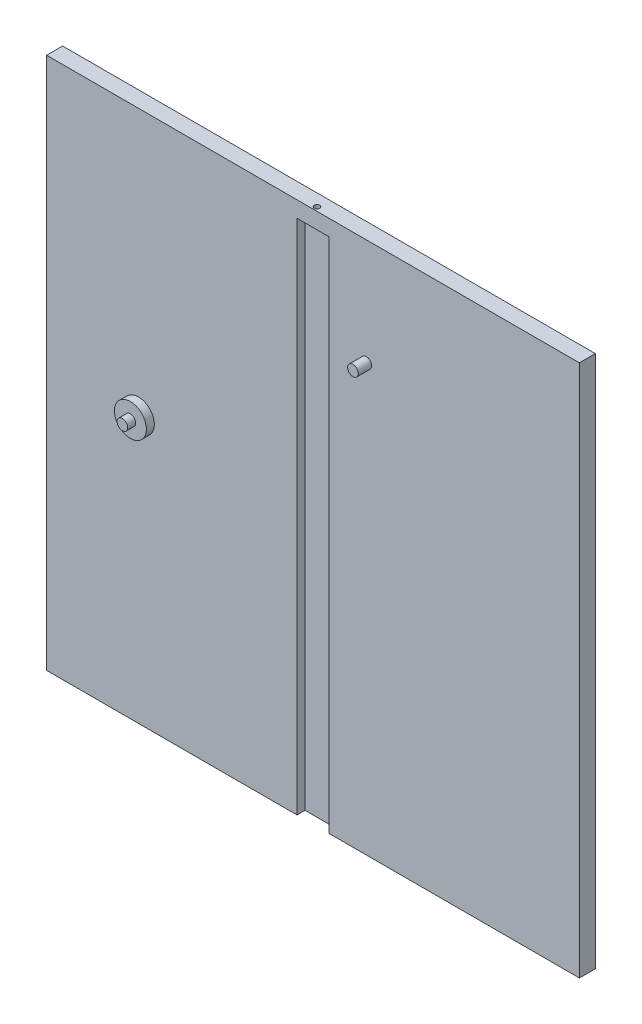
ISO-10303-21;
HEADER;
FILE_DESCRIPTION(('STEP AP214'),'2;1');
FILE_NAME('part.step','',(''),(''),'','','');
FILE_SCHEMA(('AUTOMOTIVE_DESIGN { 1 0 10303 214 1 1 1 1 }'));
ENDSEC;
DATA;
#1=APPLICATION_CONTEXT('core data for automotive mechanical design processes');
#2=APPLICATION_PROTOCOL_DEFINITION('international standard','automotive_design',2000,#1);
#3=PRODUCT_CONTEXT('',#1,'mechanical');
#4=PRODUCT('Part','Part','',(#3));
#5=PRODUCT_RELATED_PRODUCT_CATEGORY('part','',(#4));
#6=PRODUCT_DEFINITION_FORMATION('','',#4);
#7=PRODUCT_DEFINITION_CONTEXT('part definition',#1,'design');
#8=PRODUCT_DEFINITION('design','',#6,#7);
#9=PRODUCT_DEFINITION_SHAPE('','',#8);
#10=(LENGTH_UNIT() NAMED_UNIT(*) SI_UNIT(.MILLI.,.METRE.));
#11=(NAMED_UNIT(*) PLANE_ANGLE_UNIT() SI_UNIT($,.RADIAN.));
#12=(NAMED_UNIT(*) SI_UNIT($,.STERADIAN.) SOLID_ANGLE_UNIT());
#13=UNCERTAINTY_MEASURE_WITH_UNIT(LENGTH_MEASURE(1.E-05),#10,'distance_accuracy_value','');
#14=(GEOMETRIC_REPRESENTATION_CONTEXT(3) GLOBAL_UNCERTAINTY_ASSIGNED_CONTEXT((#13)) GLOBAL_UNIT_ASSIGNED_CONTEXT((#10,
#11,#12)) REPRESENTATION_CONTEXT('',''));
#15=CARTESIAN_POINT('',(0.,0.,0.));
#16=DIRECTION('',(0.,0.,1.));
#17=DIRECTION('',(1.,0.,0.));
#18=AXIS2_PLACEMENT_3D('',#15,#16,#17);
#19=CARTESIAN_POINT('',(100.,100.,6.));
#20=DIRECTION('',(0.,-1.,0.));
#21=DIRECTION('',(0.,0.,-1.));
#22=AXIS2_PLACEMENT_3D('',#19,#20,#21);
#23=PLANE('',#22);
#24=DIRECTION('',(-1.,0.,0.));
#25=VECTOR('',#24,1.);
#26=CARTESIAN_POINT('',(100.,100.,0.));
#27=LINE('',#26,#25);
#28=CARTESIAN_POINT('',(100.,100.,0.));
#29=VERTEX_POINT('',#28);
#30=CARTESIAN_POINT('',(-100.,100.,0.));
#31=VERTEX_POINT('',#30);
#32=EDGE_CURVE('E61',#29,#31,#27,.T.);
#33=ORIENTED_EDGE('',*,*,#32,.T.);
#34=DIRECTION('',(0.,0.,-1.));
#35=VECTOR('',#34,1.);
#36=CARTESIAN_POINT('',(-100.,100.,6.));
#37=LINE('',#36,#35);
#38=CARTESIAN_POINT('',(-100.,100.,6.));
#39=VERTEX_POINT('',#38);
#40=EDGE_CURVE('E139',#39,#31,#37,.T.);
#41=ORIENTED_EDGE('',*,*,#40,.F.);
#42=DIRECTION('',(-1.,0.,0.));
#43=VECTOR('',#42,1.);
#44=CARTESIAN_POINT('',(100.,100.,6.));
#45=LINE('',#44,#43);
#46=CARTESIAN_POINT('',(100.,100.,6.));
#47=VERTEX_POINT('',#46);
#48=EDGE_CURVE('E40',#47,#39,#45,.T.);
#49=ORIENTED_EDGE('',*,*,#48,.F.);
#50=DIRECTION('',(0.,0.,-1.));
#51=VECTOR('',#50,1.);
#52=CARTESIAN_POINT('',(100.,100.,6.));
#53=LINE('',#52,#51);
#54=EDGE_CURVE('E154',#47,#29,#53,.T.);
#55=ORIENTED_EDGE('',*,*,#54,.T.);
#56=EDGE_LOOP('',(#33,#41,#49,#55));
#57=FACE_BOUND('',#56,.T.);
#58=CARTESIAN_POINT('',(0.,100.,4.5));
#59=DIRECTION('',(0.,-1.,0.));
#60=DIRECTION('',(0.,0.,-1.));
#61=AXIS2_PLACEMENT_3D('',#58,#59,#60);
#62=CIRCLE('',#61,1.);
#63=CARTESIAN_POINT('',(0.,100.,3.5));
#64=VERTEX_POINT('',#63);
#65=EDGE_CURVE('E179',#64,#64,#62,.F.);
#66=ORIENTED_EDGE('',*,*,#65,.F.);
#67=EDGE_LOOP('',(#66));
#68=FACE_BOUND('',#67,.T.);
#69=ADVANCED_FACE('F15',(#57,#68),#23,.F.);
#70=CARTESIAN_POINT('',(6.,94.,3.));
#71=DIRECTION('',(0.,1.,0.));
#72=DIRECTION('',(0.,0.,1.));
#73=AXIS2_PLACEMENT_3D('',#70,#71,#72);
#74=PLANE('',#73);
#75=DIRECTION('',(-1.,0.,0.));
#76=VECTOR('',#75,1.);
#77=CARTESIAN_POINT('',(6.,94.,6.));
#78=LINE('',#77,#76);
#79=CARTESIAN_POINT('',(6.00000000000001,94.,6.));
#80=VERTEX_POINT('',#79);
#81=CARTESIAN_POINT('',(-6.,94.,6.));
#82=VERTEX_POINT('',#81);
#83=EDGE_CURVE('E109',#80,#82,#78,.T.);
#84=ORIENTED_EDGE('',*,*,#83,.T.);
#85=DIRECTION('',(0.,0.,1.));
#86=VECTOR('',#85,1.);
#87=CARTESIAN_POINT('',(-6.,94.,3.));
#88=LINE('',#87,#86);
#89=CARTESIAN_POINT('',(-6.,94.,3.));
#90=VERTEX_POINT('',#89);
#91=EDGE_CURVE('E121',#90,#82,#88,.T.);
#92=ORIENTED_EDGE('',*,*,#91,.F.);
#93=DIRECTION('',(-1.,0.,0.));
#94=VECTOR('',#93,1.);
#95=CARTESIAN_POINT('',(6.,94.,3.));
#96=LINE('',#95,#94);
#97=CARTESIAN_POINT('',(6.,94.,3.));
#98=VERTEX_POINT('',#97);
#99=EDGE_CURVE('E108',#98,#90,#96,.T.);
#100=ORIENTED_EDGE('',*,*,#99,.F.);
#101=DIRECTION('',(0.,0.,1.));
#102=VECTOR('',#101,1.);
#103=CARTESIAN_POINT('',(6.,94.,3.));
#104=LINE('',#103,#102);
#105=EDGE_CURVE('E131',#98,#80,#104,.T.);
#106=ORIENTED_EDGE('',*,*,#105,.T.);
#107=EDGE_LOOP('',(#84,#92,#100,#106));
#108=FACE_BOUND('',#107,.T.);
#109=CARTESIAN_POINT('',(0.,94.,4.5));
#110=DIRECTION('',(0.,1.,0.));
#111=DIRECTION('',(1.,0.,0.));
#112=AXIS2_PLACEMENT_3D('',#109,#110,#111);
#113=CIRCLE('',#112,1.);
#114=CARTESIAN_POINT('',(0.,94.,3.5));
#115=VERTEX_POINT('',#114);
#116=EDGE_CURVE('E170',#115,#115,#113,.T.);
#117=ORIENTED_EDGE('',*,*,#116,.T.);
#118=EDGE_LOOP('',(#117));
#119=FACE_BOUND('',#118,.T.);
#120=ADVANCED_FACE('F203',(#108,#119),#74,.F.);
#121=CARTESIAN_POINT('',(-100.,100.,6.));
#122=DIRECTION('',(1.,0.,0.));
#123=DIRECTION('',(0.,0.,-1.));
#124=AXIS2_PLACEMENT_3D('',#121,#122,#123);
#125=PLANE('',#124);
#126=DIRECTION('',(0.,-1.,0.));
#127=VECTOR('',#126,1.);
#128=CARTESIAN_POINT('',(-100.,100.,0.));
#129=LINE('',#128,#127);
#130=CARTESIAN_POINT('',(-100.,-100.,0.));
#131=VERTEX_POINT('',#130);
#132=EDGE_CURVE('E98',#31,#131,#129,.T.);
#133=ORIENTED_EDGE('',*,*,#132,.T.);
#134=DIRECTION('',(0.,0.,-1.));
#135=VECTOR('',#134,1.);
#136=CARTESIAN_POINT('',(-100.,-100.,6.));
#137=LINE('',#136,#135);
#138=CARTESIAN_POINT('',(-100.,-100.,6.));
#139=VERTEX_POINT('',#138);
#140=EDGE_CURVE('E159',#139,#131,#137,.T.);
#141=ORIENTED_EDGE('',*,*,#140,.F.);
#142=DIRECTION('',(0.,-1.,0.));
#143=VECTOR('',#142,1.);
#144=CARTESIAN_POINT('',(-100.,100.,6.));
#145=LINE('',#144,#143);
#146=EDGE_CURVE('E140',#39,#139,#145,.T.);
#147=ORIENTED_EDGE('',*,*,#146,.F.);
#148=ORIENTED_EDGE('',*,*,#40,.T.);
#149=EDGE_LOOP('',(#133,#141,#147,#148));
#150=FACE_BOUND('',#149,.T.);
#151=ADVANCED_FACE('F17',(#150),#125,.F.);
#152=CARTESIAN_POINT('',(-100.,-100.,6.));
#153=DIRECTION('',(0.,1.,0.));
#154=DIRECTION('',(0.,0.,1.));
#155=AXIS2_PLACEMENT_3D('',#152,#153,#154);
#156=PLANE('',#155);
#157=DIRECTION('',(1.,0.,0.));
#158=VECTOR('',#157,1.);
#159=CARTESIAN_POINT('',(-5.99999999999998,-100.,3.));
#160=LINE('',#159,#158);
#161=CARTESIAN_POINT('',(-5.99999999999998,-100.,3.));
#162=VERTEX_POINT('',#161);
#163=CARTESIAN_POINT('',(6.,-100.,3.));
#164=VERTEX_POINT('',#163);
#165=EDGE_CURVE('E105',#162,#164,#160,.T.);
#166=ORIENTED_EDGE('',*,*,#165,.F.);
#167=DIRECTION('',(0.,0.,1.));
#168=VECTOR('',#167,1.);
#169=CARTESIAN_POINT('',(-5.99999999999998,-100.,3.));
#170=LINE('',#169,#168);
#171=CARTESIAN_POINT('',(-5.99999999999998,-100.,6.));
#172=VERTEX_POINT('',#171);
#173=EDGE_CURVE('E91',#162,#172,#170,.T.);
#174=ORIENTED_EDGE('',*,*,#173,.T.);
#175=DIRECTION('',(1.,0.,0.));
#176=VECTOR('',#175,1.);
#177=CARTESIAN_POINT('',(-100.,-100.,6.));
#178=LINE('',#177,#176);
#179=EDGE_CURVE('E69',#139,#172,#178,.T.);
#180=ORIENTED_EDGE('',*,*,#179,.F.);
#181=ORIENTED_EDGE('',*,*,#140,.T.);
#182=DIRECTION('',(1.,0.,0.));
#183=VECTOR('',#182,1.);
#184=CARTESIAN_POINT('',(-100.,-100.,0.));
#185=LINE('',#184,#183);
#186=CARTESIAN_POINT('',(100.,-100.,0.));
#187=VERTEX_POINT('',#186);
#188=EDGE_CURVE('E142',#131,#187,#185,.T.);
#189=ORIENTED_EDGE('',*,*,#188,.T.);
#190=DIRECTION('',(0.,0.,-1.));
#191=VECTOR('',#190,1.);
#192=CARTESIAN_POINT('',(100.,-100.,6.));
#193=LINE('',#192,#191);
#194=CARTESIAN_POINT('',(100.,-100.,6.));
#195=VERTEX_POINT('',#194);
#196=EDGE_CURVE('E156',#195,#187,#193,.T.);
#197=ORIENTED_EDGE('',*,*,#196,.F.);
#198=CARTESIAN_POINT('',(6.,-100.,6.));
#199=VERTEX_POINT('',#198);
#200=EDGE_CURVE('E136',#199,#195,#178,.T.);
#201=ORIENTED_EDGE('',*,*,#200,.F.);
#202=DIRECTION('',(0.,0.,1.));
#203=VECTOR('',#202,1.);
#204=CARTESIAN_POINT('',(6.,-100.,3.));
#205=LINE('',#204,#203);
#206=EDGE_CURVE('E99',#164,#199,#205,.T.);
#207=ORIENTED_EDGE('',*,*,#206,.F.);
#208=EDGE_LOOP('',(#166,#174,#180,#181,#189,#197,#201,#207));
#209=FACE_BOUND('',#208,.T.);
#210=ADVANCED_FACE('F112',(#209),#156,.F.);
#211=CARTESIAN_POINT('',(100.,-100.,6.));
#212=DIRECTION('',(-1.,0.,0.));
#213=DIRECTION('',(0.,0.,1.));
#214=AXIS2_PLACEMENT_3D('',#211,#212,#213);
#215=PLANE('',#214);
#216=DIRECTION('',(0.,1.,0.));
#217=VECTOR('',#216,1.);
#218=CARTESIAN_POINT('',(100.,-100.,0.));
#219=LINE('',#218,#217);
#220=EDGE_CURVE('E145',#187,#29,#219,.T.);
#221=ORIENTED_EDGE('',*,*,#220,.T.);
#222=ORIENTED_EDGE('',*,*,#54,.F.);
#223=DIRECTION('',(0.,1.,0.));
#224=VECTOR('',#223,1.);
#225=CARTESIAN_POINT('',(100.,-100.,6.));
#226=LINE('',#225,#224);
#227=EDGE_CURVE('E135',#195,#47,#226,.T.);
#228=ORIENTED_EDGE('',*,*,#227,.F.);
#229=ORIENTED_EDGE('',*,*,#196,.T.);
#230=EDGE_LOOP('',(#221,#222,#228,#229));
#231=FACE_BOUND('',#230,.T.);
#232=ADVANCED_FACE('F215',(#231),#215,.F.);
#233=CARTESIAN_POINT('',(-100.,-100.,6.));
#234=DIRECTION('',(0.,0.,1.));
#235=DIRECTION('',(1.,0.,0.));
#236=AXIS2_PLACEMENT_3D('',#233,#234,#235);
#237=PLANE('',#236);
#238=CARTESIAN_POINT('',(-65.5553416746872,0.138594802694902,6.));
#239=DIRECTION('',(0.,0.,1.));
#240=DIRECTION('',(1.,0.,0.));
#241=AXIS2_PLACEMENT_3D('',#238,#239,#240);
#242=CIRCLE('',#241,6.);
#243=CARTESIAN_POINT('',(-59.5553416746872,0.138594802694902,6.));
#244=VERTEX_POINT('',#243);
#245=EDGE_CURVE('E9',#244,#244,#242,.T.);
#246=ORIENTED_EDGE('',*,*,#245,.F.);
#247=EDGE_LOOP('',(#246));
#248=FACE_BOUND('',#247,.T.);
#249=CARTESIAN_POINT('',(20.,60.,6.));
#250=DIRECTION('',(0.,0.,1.));
#251=DIRECTION('',(1.,0.,0.));
#252=AXIS2_PLACEMENT_3D('',#249,#250,#251);
#253=CIRCLE('',#252,2.);
#254=CARTESIAN_POINT('',(22.,60.,6.));
#255=VERTEX_POINT('',#254);
#256=EDGE_CURVE('E24',#255,#255,#253,.T.);
#257=ORIENTED_EDGE('',*,*,#256,.F.);
#258=EDGE_LOOP('',(#257));
#259=FACE_BOUND('',#258,.T.);
#260=DIRECTION('',(0.,-1.,0.));
#261=VECTOR('',#260,1.);
#262=CARTESIAN_POINT('',(-5.99999999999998,94.,6.));
#263=LINE('',#262,#261);
#264=EDGE_CURVE('E96',#82,#172,#263,.T.);
#265=ORIENTED_EDGE('',*,*,#264,.F.);
#266=ORIENTED_EDGE('',*,*,#83,.F.);
#267=DIRECTION('',(0.,1.,0.));
#268=VECTOR('',#267,1.);
#269=CARTESIAN_POINT('',(6.,-100.,6.));
#270=LINE('',#269,#268);
#271=EDGE_CURVE('E31',#199,#80,#270,.T.);
#272=ORIENTED_EDGE('',*,*,#271,.F.);
#273=ORIENTED_EDGE('',*,*,#200,.T.);
#274=ORIENTED_EDGE('',*,*,#227,.T.);
#275=ORIENTED_EDGE('',*,*,#48,.T.);
#276=ORIENTED_EDGE('',*,*,#146,.T.);
#277=ORIENTED_EDGE('',*,*,#179,.T.);
#278=EDGE_LOOP('',(#265,#266,#272,#273,#274,#275,#276,#277));
#279=FACE_BOUND('',#278,.T.);
#280=ADVANCED_FACE('F217',(#248,#259,#279),#237,.T.);
#281=CARTESIAN_POINT('',(-100.,-100.,0.));
#282=DIRECTION('',(0.,0.,1.));
#283=DIRECTION('',(1.,0.,0.));
#284=AXIS2_PLACEMENT_3D('',#281,#282,#283);
#285=PLANE('',#284);
#286=ORIENTED_EDGE('',*,*,#132,.F.);
#287=ORIENTED_EDGE('',*,*,#32,.F.);
#288=ORIENTED_EDGE('',*,*,#220,.F.);
#289=ORIENTED_EDGE('',*,*,#188,.F.);
#290=EDGE_LOOP('',(#286,#287,#288,#289));
#291=FACE_BOUND('',#290,.T.);
#292=ADVANCED_FACE('F213',(#291),#285,.F.);
#293=CARTESIAN_POINT('',(-5.99999999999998,94.,3.));
#294=DIRECTION('',(-1.,0.,0.));
#295=DIRECTION('',(0.,0.,1.));
#296=AXIS2_PLACEMENT_3D('',#293,#294,#295);
#297=PLANE('',#296);
#298=ORIENTED_EDGE('',*,*,#264,.T.);
#299=ORIENTED_EDGE('',*,*,#173,.F.);
#300=DIRECTION('',(0.,-1.,0.));
#301=VECTOR('',#300,1.);
#302=CARTESIAN_POINT('',(-5.99999999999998,94.,3.));
#303=LINE('',#302,#301);
#304=EDGE_CURVE('E94',#90,#162,#303,.T.);
#305=ORIENTED_EDGE('',*,*,#304,.F.);
#306=ORIENTED_EDGE('',*,*,#91,.T.);
#307=EDGE_LOOP('',(#298,#299,#305,#306));
#308=FACE_BOUND('',#307,.T.);
#309=ADVANCED_FACE('F93',(#308),#297,.F.);
#310=CARTESIAN_POINT('',(6.,-100.,3.));
#311=DIRECTION('',(1.,0.,0.));
#312=DIRECTION('',(0.,0.,-1.));
#313=AXIS2_PLACEMENT_3D('',#310,#311,#312);
#314=PLANE('',#313);
#315=ORIENTED_EDGE('',*,*,#271,.T.);
#316=ORIENTED_EDGE('',*,*,#105,.F.);
#317=DIRECTION('',(0.,1.,0.));
#318=VECTOR('',#317,1.);
#319=CARTESIAN_POINT('',(6.,-100.,3.));
#320=LINE('',#319,#318);
#321=EDGE_CURVE('E114',#164,#98,#320,.T.);
#322=ORIENTED_EDGE('',*,*,#321,.F.);
#323=ORIENTED_EDGE('',*,*,#206,.T.);
#324=EDGE_LOOP('',(#315,#316,#322,#323));
#325=FACE_BOUND('',#324,.T.);
#326=ADVANCED_FACE('F236',(#325),#314,.F.);
#327=CARTESIAN_POINT('',(-5.99999999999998,-100.,3.));
#328=DIRECTION('',(0.,0.,1.));
#329=DIRECTION('',(1.,0.,0.));
#330=AXIS2_PLACEMENT_3D('',#327,#328,#329);
#331=PLANE('',#330);
#332=ORIENTED_EDGE('',*,*,#304,.T.);
#333=ORIENTED_EDGE('',*,*,#165,.T.);
#334=ORIENTED_EDGE('',*,*,#321,.T.);
#335=ORIENTED_EDGE('',*,*,#99,.T.);
#336=EDGE_LOOP('',(#332,#333,#334,#335));
#337=FACE_BOUND('',#336,.T.);
#338=ADVANCED_FACE('F103',(#337),#331,.T.);
#339=CARTESIAN_POINT('',(20.,60.,11.));
#340=DIRECTION('',(0.,0.,-1.));
#341=DIRECTION('',(-1.,0.,0.));
#342=AXIS2_PLACEMENT_3D('',#339,#340,#341);
#343=CYLINDRICAL_SURFACE('',#342,2.);
#344=CARTESIAN_POINT('',(20.,60.,11.));
#345=DIRECTION('',(0.,0.,-1.));
#346=DIRECTION('',(1.,0.,0.));
#347=AXIS2_PLACEMENT_3D('',#344,#345,#346);
#348=CIRCLE('',#347,2.);
#349=CARTESIAN_POINT('',(22.,60.,11.));
#350=VERTEX_POINT('',#349);
#351=EDGE_CURVE('E118',#350,#350,#348,.T.);
#352=ORIENTED_EDGE('',*,*,#351,.T.);
#353=EDGE_LOOP('',(#352));
#354=FACE_BOUND('',#353,.T.);
#355=ORIENTED_EDGE('',*,*,#256,.T.);
#356=EDGE_LOOP('',(#355));
#357=FACE_BOUND('',#356,.T.);
#358=ADVANCED_FACE('F186',(#354,#357),#343,.T.);
#359=CARTESIAN_POINT('',(20.,60.,11.));
#360=DIRECTION('',(0.,0.,-1.));
#361=DIRECTION('',(-1.,0.,0.));
#362=AXIS2_PLACEMENT_3D('',#359,#360,#361);
#363=PLANE('',#362);
#364=ORIENTED_EDGE('',*,*,#351,.F.);
#365=EDGE_LOOP('',(#364));
#366=FACE_BOUND('',#365,.T.);
#367=ADVANCED_FACE('F189',(#366),#363,.F.);
#368=CARTESIAN_POINT('',(0.,150.386397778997,4.5));
#369=DIRECTION('',(0.,-1.,0.));
#370=DIRECTION('',(0.,0.,-1.));
#371=AXIS2_PLACEMENT_3D('',#368,#369,#370);
#372=CYLINDRICAL_SURFACE('',#371,1.);
#373=CARTESIAN_POINT('',(0.,94.,3.5));
#374=CARTESIAN_POINT('',(0.,94.0625,3.5));
#375=CARTESIAN_POINT('',(0.,94.125,3.5));
#376=CARTESIAN_POINT('',(0.,94.25,3.5));
#377=CARTESIAN_POINT('',(0.,94.3125,3.5));
#378=CARTESIAN_POINT('',(0.,94.4375,3.5));
#379=CARTESIAN_POINT('',(0.,94.5,3.5));
#380=CARTESIAN_POINT('',(0.,94.625,3.5));
#381=CARTESIAN_POINT('',(0.,94.6875,3.5));
#382=CARTESIAN_POINT('',(0.,94.8125,3.5));
#383=CARTESIAN_POINT('',(0.,94.875,3.5));
#384=CARTESIAN_POINT('',(0.,95.,3.5));
#385=CARTESIAN_POINT('',(0.,95.0625,3.5));
#386=CARTESIAN_POINT('',(0.,95.1875,3.5));
#387=CARTESIAN_POINT('',(0.,95.25,3.5));
#388=CARTESIAN_POINT('',(0.,95.375,3.5));
#389=CARTESIAN_POINT('',(0.,95.4375,3.5));
#390=CARTESIAN_POINT('',(0.,95.5625,3.5));
#391=CARTESIAN_POINT('',(0.,95.625,3.5));
#392=CARTESIAN_POINT('',(0.,95.75,3.5));
#393=CARTESIAN_POINT('',(0.,95.8125,3.5));
#394=CARTESIAN_POINT('',(0.,95.9375,3.5));
#395=CARTESIAN_POINT('',(0.,96.,3.5));
#396=CARTESIAN_POINT('',(0.,96.125,3.5));
#397=CARTESIAN_POINT('',(0.,96.1875,3.5));
#398=CARTESIAN_POINT('',(0.,96.3125,3.5));
#399=CARTESIAN_POINT('',(0.,96.375,3.5));
#400=CARTESIAN_POINT('',(0.,96.5,3.5));
#401=CARTESIAN_POINT('',(0.,96.5625,3.5));
#402=CARTESIAN_POINT('',(0.,96.6875,3.5));
#403=CARTESIAN_POINT('',(0.,96.75,3.5));
#404=CARTESIAN_POINT('',(0.,96.875,3.5));
#405=CARTESIAN_POINT('',(0.,96.9375,3.5));
#406=CARTESIAN_POINT('',(0.,97.0625,3.5));
#407=CARTESIAN_POINT('',(0.,97.125,3.5));
#408=CARTESIAN_POINT('',(0.,97.25,3.5));
#409=CARTESIAN_POINT('',(0.,97.3125,3.5));
#410=CARTESIAN_POINT('',(0.,97.4375,3.5));
#411=CARTESIAN_POINT('',(0.,97.5,3.5));
#412=CARTESIAN_POINT('',(0.,97.625,3.5));
#413=CARTESIAN_POINT('',(0.,97.6875,3.5));
#414=CARTESIAN_POINT('',(0.,97.8125,3.5));
#415=CARTESIAN_POINT('',(0.,97.875,3.5));
#416=CARTESIAN_POINT('',(0.,98.,3.5));
#417=CARTESIAN_POINT('',(0.,98.0625,3.5));
#418=CARTESIAN_POINT('',(0.,98.1875,3.5));
#419=CARTESIAN_POINT('',(0.,98.25,3.5));
#420=CARTESIAN_POINT('',(0.,98.375,3.5));
#421=CARTESIAN_POINT('',(0.,98.4375,3.5));
#422=CARTESIAN_POINT('',(0.,98.5625,3.5));
#423=CARTESIAN_POINT('',(0.,98.625,3.5));
#424=CARTESIAN_POINT('',(0.,98.75,3.5));
#425=CARTESIAN_POINT('',(0.,98.8125,3.5));
#426=CARTESIAN_POINT('',(0.,98.9375,3.5));
#427=CARTESIAN_POINT('',(0.,99.,3.5));
#428=CARTESIAN_POINT('',(0.,99.125,3.5));
#429=CARTESIAN_POINT('',(0.,99.1875,3.5));
#430=CARTESIAN_POINT('',(0.,99.3125,3.5));
#431=CARTESIAN_POINT('',(0.,99.375,3.5));
#432=CARTESIAN_POINT('',(0.,99.5,3.5));
#433=CARTESIAN_POINT('',(0.,99.5625,3.5));
#434=CARTESIAN_POINT('',(0.,99.6875,3.5));
#435=CARTESIAN_POINT('',(0.,99.75,3.5));
#436=CARTESIAN_POINT('',(0.,99.875,3.5));
#437=CARTESIAN_POINT('',(0.,99.9375,3.5));
#438=CARTESIAN_POINT('',(0.,100.,3.5));
#439=B_SPLINE_CURVE_WITH_KNOTS('',3,(#373,#374,#375,#376,#377,#378,#379,#380,#381,#382,#383,
#384,#385,#386,#387,#388,#389,#390,#391,#392,#393,#394,#395,#396,#397,#398,#399,#400,#401,#402,
#403,#404,#405,#406,#407,#408,#409,#410,#411,#412,#413,#414,#415,#416,#417,#418,#419,#420,#421,
#422,#423,#424,#425,#426,#427,#428,#429,#430,#431,#432,#433,#434,#435,#436,#437,#438),
.UNSPECIFIED.,.F.,.F.,(4,2,2,2,2,2,2,2,2,2,2,2,2,2,2,2,2,2,2,2,2,2,2,2,2,2,2,2,2,2,2,2,4),(0.,
0.187500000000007,0.375000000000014,0.562500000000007,0.750000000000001,0.937500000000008,
1.12500000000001,1.31250000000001,1.5,1.68750000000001,1.87500000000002,2.06250000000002,
2.25000000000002,2.43750000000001,2.62500000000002,2.81250000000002,3.00000000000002,
3.18750000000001,3.37500000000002,3.56250000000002,3.75000000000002,3.93750000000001,
4.12500000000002,4.31250000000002,4.50000000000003,4.68750000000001,4.87500000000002,
5.06250000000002,5.25000000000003,5.43750000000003,5.62500000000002,5.81250000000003,
6.00000000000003),.UNSPECIFIED.);
#440=EDGE_CURVE('BSEAM191',#115,#64,#439,.T.);
#441=ORIENTED_EDGE('',*,*,#116,.F.);
#442=ORIENTED_EDGE('',*,*,#65,.T.);
#443=ORIENTED_EDGE('',*,*,#440,.T.);
#444=ORIENTED_EDGE('',*,*,#440,.F.);
#445=EDGE_LOOP('',(#441,#443,#442,#444));
#446=FACE_BOUND('',#445,.T.);
#447=ADVANCED_FACE('F191',(#446),#372,.F.);
#448=CARTESIAN_POINT('',(-65.5553416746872,0.138594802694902,9.));
#449=DIRECTION('',(0.,0.,-1.));
#450=DIRECTION('',(-1.,0.,0.));
#451=AXIS2_PLACEMENT_3D('',#448,#449,#450);
#452=CYLINDRICAL_SURFACE('',#451,6.);
#453=CARTESIAN_POINT('',(-65.5553416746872,0.138594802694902,9.));
#454=DIRECTION('',(0.,0.,-1.));
#455=DIRECTION('',(1.,0.,0.));
#456=AXIS2_PLACEMENT_3D('',#453,#454,#455);
#457=CIRCLE('',#456,6.);
#458=CARTESIAN_POINT('',(-59.5553416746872,0.138594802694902,9.));
#459=VERTEX_POINT('',#458);
#460=EDGE_CURVE('E166',#459,#459,#457,.T.);
#461=ORIENTED_EDGE('',*,*,#460,.T.);
#462=EDGE_LOOP('',(#461));
#463=FACE_BOUND('',#462,.T.);
#464=ORIENTED_EDGE('',*,*,#245,.T.);
#465=EDGE_LOOP('',(#464));
#466=FACE_BOUND('',#465,.T.);
#467=ADVANCED_FACE('F198',(#463,#466),#452,.T.);
#468=CARTESIAN_POINT('',(-65.5553416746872,0.138594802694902,9.));
#469=DIRECTION('',(0.,0.,-1.));
#470=DIRECTION('',(-1.,0.,0.));
#471=AXIS2_PLACEMENT_3D('',#468,#469,#470);
#472=PLANE('',#471);
#473=CARTESIAN_POINT('',(-65.5553416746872,0.138594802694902,9.));
#474=DIRECTION('',(0.,0.,-1.));
#475=DIRECTION('',(-1.,0.,0.));
#476=AXIS2_PLACEMENT_3D('',#473,#474,#475);
#477=CIRCLE('',#476,2.);
#478=CARTESIAN_POINT('',(-67.5553416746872,0.138594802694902,9.));
#479=VERTEX_POINT('',#478);
#480=EDGE_CURVE('E163',#479,#479,#477,.F.);
#481=ORIENTED_EDGE('',*,*,#480,.F.);
#482=EDGE_LOOP('',(#481));
#483=FACE_BOUND('',#482,.T.);
#484=ORIENTED_EDGE('',*,*,#460,.F.);
#485=EDGE_LOOP('',(#484));
#486=FACE_BOUND('',#485,.T.);
#487=ADVANCED_FACE('F255',(#483,#486),#472,.F.);
#488=CARTESIAN_POINT('',(-65.5553416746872,0.138594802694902,12.));
#489=DIRECTION('',(0.,0.,-1.));
#490=DIRECTION('',(-1.,0.,0.));
#491=AXIS2_PLACEMENT_3D('',#488,#489,#490);
#492=PLANE('',#491);
#493=CARTESIAN_POINT('',(-65.5553416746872,0.138594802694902,12.));
#494=DIRECTION('',(0.,0.,-1.));
#495=DIRECTION('',(0.,1.,0.));
#496=AXIS2_PLACEMENT_3D('',#493,#494,#495);
#497=CIRCLE('',#496,2.);
#498=CARTESIAN_POINT('',(-65.5553416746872,2.1385948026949,12.));
#499=VERTEX_POINT('',#498);
#500=EDGE_CURVE('E165',#499,#499,#497,.T.);
#501=ORIENTED_EDGE('',*,*,#500,.F.);
#502=EDGE_LOOP('',(#501));
#503=FACE_BOUND('',#502,.T.);
#504=ADVANCED_FACE('F260',(#503),#492,.F.);
#505=CARTESIAN_POINT('',(-65.5553416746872,0.138594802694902,12.));
#506=DIRECTION('',(0.,0.,-1.));
#507=DIRECTION('',(-1.,0.,0.));
#508=AXIS2_PLACEMENT_3D('',#505,#506,#507);
#509=CYLINDRICAL_SURFACE('',#508,2.);
#510=ORIENTED_EDGE('',*,*,#500,.T.);
#511=EDGE_LOOP('',(#510));
#512=FACE_BOUND('',#511,.T.);
#513=ORIENTED_EDGE('',*,*,#480,.T.);
#514=EDGE_LOOP('',(#513));
#515=FACE_BOUND('',#514,.T.);
#516=ADVANCED_FACE('F266',(#512,#515),#509,.T.);
#517=CLOSED_SHELL('',(#69,#120,#151,#210,#232,#280,#292,#309,#326,#338,#358,#367,#447,#467,#487,
#504,#516));
#518=MANIFOLD_SOLID_BREP('B1',#517);
#519=ADVANCED_BREP_SHAPE_REPRESENTATION('',(#18,#518),#14);
#520=SHAPE_DEFINITION_REPRESENTATION(#9,#519);
ENDSEC;
END-ISO-10303-21;
